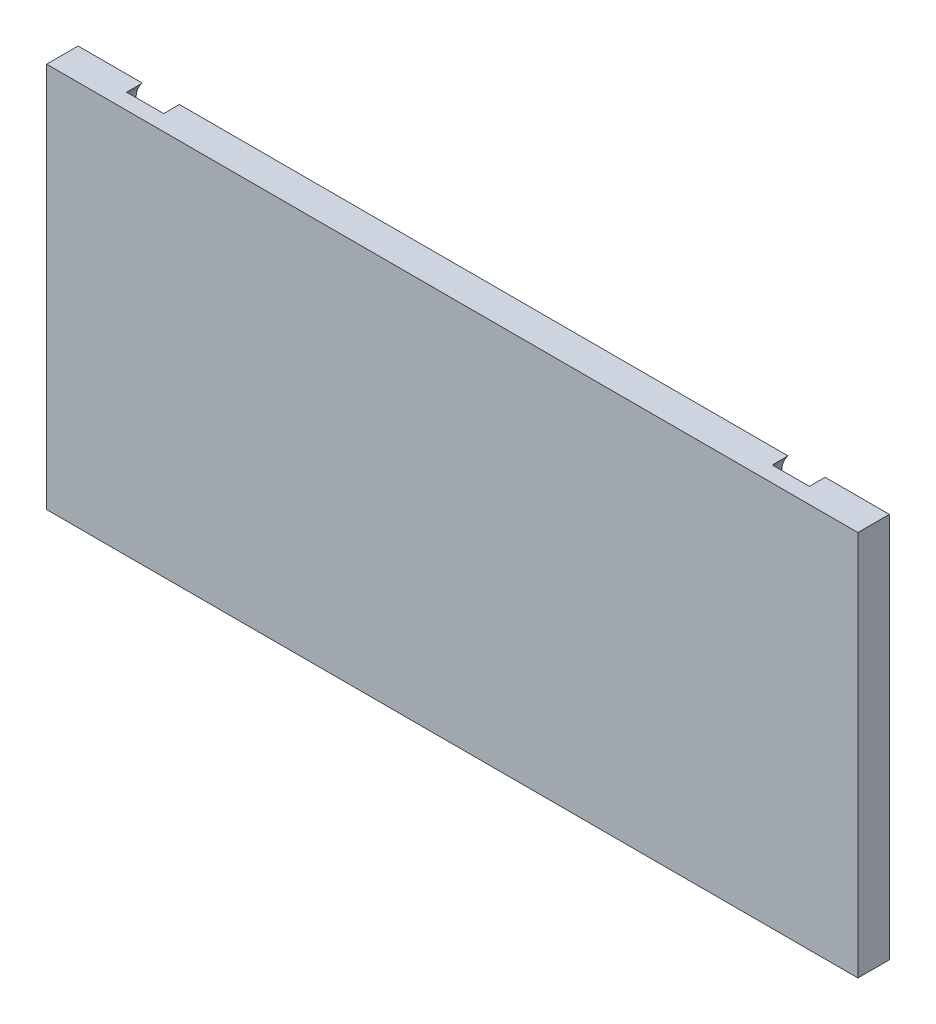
ISO-10303-21;
HEADER;
FILE_DESCRIPTION(('STEP AP214'),'2;1');
FILE_NAME('part.step','',(''),(''),'','','');
FILE_SCHEMA(('AUTOMOTIVE_DESIGN { 1 0 10303 214 1 1 1 1 }'));
ENDSEC;
DATA;
#1=APPLICATION_CONTEXT('core data for automotive mechanical design processes');
#2=APPLICATION_PROTOCOL_DEFINITION('international standard','automotive_design',2000,#1);
#3=PRODUCT_CONTEXT('',#1,'mechanical');
#4=PRODUCT('Part','Part','',(#3));
#5=PRODUCT_RELATED_PRODUCT_CATEGORY('part','',(#4));
#6=PRODUCT_DEFINITION_FORMATION('','',#4);
#7=PRODUCT_DEFINITION_CONTEXT('part definition',#1,'design');
#8=PRODUCT_DEFINITION('design','',#6,#7);
#9=PRODUCT_DEFINITION_SHAPE('','',#8);
#10=(LENGTH_UNIT() NAMED_UNIT(*) SI_UNIT(.MILLI.,.METRE.));
#11=(NAMED_UNIT(*) PLANE_ANGLE_UNIT() SI_UNIT($,.RADIAN.));
#12=(NAMED_UNIT(*) SI_UNIT($,.STERADIAN.) SOLID_ANGLE_UNIT());
#13=UNCERTAINTY_MEASURE_WITH_UNIT(LENGTH_MEASURE(1.E-05),#10,'distance_accuracy_value','');
#14=(GEOMETRIC_REPRESENTATION_CONTEXT(3) GLOBAL_UNCERTAINTY_ASSIGNED_CONTEXT((#13)) GLOBAL_UNIT_ASSIGNED_CONTEXT((#10,
#11,#12)) REPRESENTATION_CONTEXT('',''));
#15=CARTESIAN_POINT('',(0.,0.,0.));
#16=DIRECTION('',(0.,0.,1.));
#17=DIRECTION('',(1.,0.,0.));
#18=AXIS2_PLACEMENT_3D('',#15,#16,#17);
#19=CARTESIAN_POINT('',(245.,-116.5,19.));
#20=DIRECTION('',(-1.,0.,0.));
#21=DIRECTION('',(0.,0.,1.));
#22=AXIS2_PLACEMENT_3D('',#19,#20,#21);
#23=PLANE('',#22);
#24=DIRECTION('',(0.,1.,0.));
#25=VECTOR('',#24,1.);
#26=CARTESIAN_POINT('',(245.,-116.5,0.));
#27=LINE('',#26,#25);
#28=CARTESIAN_POINT('',(245.,-116.5,0.));
#29=VERTEX_POINT('',#28);
#30=CARTESIAN_POINT('',(245.,116.5,0.));
#31=VERTEX_POINT('',#30);
#32=EDGE_CURVE('E176',#29,#31,#27,.T.);
#33=ORIENTED_EDGE('',*,*,#32,.T.);
#34=DIRECTION('',(0.,0.,-1.));
#35=VECTOR('',#34,1.);
#36=CARTESIAN_POINT('',(245.,116.5,19.));
#37=LINE('',#36,#35);
#38=CARTESIAN_POINT('',(245.,116.5,19.));
#39=VERTEX_POINT('',#38);
#40=EDGE_CURVE('E208',#39,#31,#37,.T.);
#41=ORIENTED_EDGE('',*,*,#40,.F.);
#42=DIRECTION('',(0.,1.,0.));
#43=VECTOR('',#42,1.);
#44=CARTESIAN_POINT('',(245.,-116.5,19.));
#45=LINE('',#44,#43);
#46=CARTESIAN_POINT('',(245.,-116.5,19.));
#47=VERTEX_POINT('',#46);
#48=EDGE_CURVE('E177',#47,#39,#45,.T.);
#49=ORIENTED_EDGE('',*,*,#48,.F.);
#50=DIRECTION('',(0.,0.,-1.));
#51=VECTOR('',#50,1.);
#52=CARTESIAN_POINT('',(245.,-116.5,19.));
#53=LINE('',#52,#51);
#54=EDGE_CURVE('E187',#47,#29,#53,.T.);
#55=ORIENTED_EDGE('',*,*,#54,.T.);
#56=EDGE_LOOP('',(#33,#41,#49,#55));
#57=FACE_BOUND('',#56,.T.);
#58=ADVANCED_FACE('F32',(#57),#23,.F.);
#59=CARTESIAN_POINT('',(-245.,116.5,19.));
#60=DIRECTION('',(0.,-1.,0.));
#61=DIRECTION('',(0.,0.,-1.));
#62=AXIS2_PLACEMENT_3D('',#59,#60,#61);
#63=PLANE('',#62);
#64=DIRECTION('',(1.,0.,0.));
#65=VECTOR('',#64,1.);
#66=CARTESIAN_POINT('',(-245.,116.5,9.5));
#67=LINE('',#66,#65);
#68=CARTESIAN_POINT('',(183.819660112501,116.5,9.5));
#69=VERTEX_POINT('',#68);
#70=CARTESIAN_POINT('',(206.180339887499,116.5,9.5));
#71=VERTEX_POINT('',#70);
#72=EDGE_CURVE('E11',#69,#71,#67,.T.);
#73=ORIENTED_EDGE('',*,*,#72,.F.);
#74=DIRECTION('',(0.,0.,-1.));
#75=VECTOR('',#74,1.);
#76=CARTESIAN_POINT('',(183.819660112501,116.5,9.5));
#77=LINE('',#76,#75);
#78=CARTESIAN_POINT('',(183.819660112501,116.5,0.));
#79=VERTEX_POINT('',#78);
#80=EDGE_CURVE('E174',#69,#79,#77,.T.);
#81=ORIENTED_EDGE('',*,*,#80,.T.);
#82=DIRECTION('',(-1.,0.,0.));
#83=VECTOR('',#82,1.);
#84=CARTESIAN_POINT('',(-245.,116.5,0.));
#85=LINE('',#84,#83);
#86=CARTESIAN_POINT('',(-183.819660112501,116.5,0.));
#87=VERTEX_POINT('',#86);
#88=EDGE_CURVE('E165',#79,#87,#85,.T.);
#89=ORIENTED_EDGE('',*,*,#88,.T.);
#90=DIRECTION('',(0.,0.,-1.));
#91=VECTOR('',#90,1.);
#92=CARTESIAN_POINT('',(-183.819660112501,116.5,9.5));
#93=LINE('',#92,#91);
#94=CARTESIAN_POINT('',(-183.819660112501,116.5,9.5));
#95=VERTEX_POINT('',#94);
#96=EDGE_CURVE('E46',#87,#95,#93,.F.);
#97=ORIENTED_EDGE('',*,*,#96,.T.);
#98=DIRECTION('',(1.,0.,0.));
#99=VECTOR('',#98,1.);
#100=CARTESIAN_POINT('',(-245.,116.5,9.5));
#101=LINE('',#100,#99);
#102=CARTESIAN_POINT('',(-206.180339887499,116.5,9.5));
#103=VERTEX_POINT('',#102);
#104=EDGE_CURVE('E39',#103,#95,#101,.T.);
#105=ORIENTED_EDGE('',*,*,#104,.F.);
#106=DIRECTION('',(0.,0.,-1.));
#107=VECTOR('',#106,1.);
#108=CARTESIAN_POINT('',(-206.180339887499,116.5,9.5));
#109=LINE('',#108,#107);
#110=CARTESIAN_POINT('',(-206.180339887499,116.5,0.));
#111=VERTEX_POINT('',#110);
#112=EDGE_CURVE('E157',#103,#111,#109,.T.);
#113=ORIENTED_EDGE('',*,*,#112,.T.);
#114=CARTESIAN_POINT('',(-245.,116.5,0.));
#115=VERTEX_POINT('',#114);
#116=EDGE_CURVE('E190',#111,#115,#85,.T.);
#117=ORIENTED_EDGE('',*,*,#116,.T.);
#118=DIRECTION('',(0.,0.,-1.));
#119=VECTOR('',#118,1.);
#120=CARTESIAN_POINT('',(-245.,116.5,19.));
#121=LINE('',#120,#119);
#122=CARTESIAN_POINT('',(-245.,116.5,19.));
#123=VERTEX_POINT('',#122);
#124=EDGE_CURVE('E205',#123,#115,#121,.T.);
#125=ORIENTED_EDGE('',*,*,#124,.F.);
#126=DIRECTION('',(-1.,0.,0.));
#127=VECTOR('',#126,1.);
#128=CARTESIAN_POINT('',(-245.,116.5,19.));
#129=LINE('',#128,#127);
#130=EDGE_CURVE('E180',#39,#123,#129,.T.);
#131=ORIENTED_EDGE('',*,*,#130,.F.);
#132=ORIENTED_EDGE('',*,*,#40,.T.);
#133=CARTESIAN_POINT('',(206.180339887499,116.5,0.));
#134=VERTEX_POINT('',#133);
#135=EDGE_CURVE('E191',#31,#134,#85,.T.);
#136=ORIENTED_EDGE('',*,*,#135,.T.);
#137=DIRECTION('',(0.,0.,-1.));
#138=VECTOR('',#137,1.);
#139=CARTESIAN_POINT('',(206.180339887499,116.5,9.5));
#140=LINE('',#139,#138);
#141=EDGE_CURVE('E54',#134,#71,#140,.F.);
#142=ORIENTED_EDGE('',*,*,#141,.T.);
#143=EDGE_LOOP('',(#73,#81,#89,#97,#105,#113,#117,#125,#131,#132,#136,#142));
#144=FACE_BOUND('',#143,.T.);
#145=ADVANCED_FACE('F162',(#144),#63,.F.);
#146=CARTESIAN_POINT('',(-245.,-116.5,19.));
#147=DIRECTION('',(1.,0.,0.));
#148=DIRECTION('',(0.,0.,-1.));
#149=AXIS2_PLACEMENT_3D('',#146,#147,#148);
#150=PLANE('',#149);
#151=DIRECTION('',(0.,-1.,0.));
#152=VECTOR('',#151,1.);
#153=CARTESIAN_POINT('',(-245.,-116.5,0.));
#154=LINE('',#153,#152);
#155=CARTESIAN_POINT('',(-245.,-116.5,0.));
#156=VERTEX_POINT('',#155);
#157=EDGE_CURVE('E194',#115,#156,#154,.T.);
#158=ORIENTED_EDGE('',*,*,#157,.T.);
#159=DIRECTION('',(0.,0.,-1.));
#160=VECTOR('',#159,1.);
#161=CARTESIAN_POINT('',(-245.,-116.5,19.));
#162=LINE('',#161,#160);
#163=CARTESIAN_POINT('',(-245.,-116.5,19.));
#164=VERTEX_POINT('',#163);
#165=EDGE_CURVE('E202',#164,#156,#162,.T.);
#166=ORIENTED_EDGE('',*,*,#165,.F.);
#167=DIRECTION('',(0.,-1.,0.));
#168=VECTOR('',#167,1.);
#169=CARTESIAN_POINT('',(-245.,-116.5,19.));
#170=LINE('',#169,#168);
#171=EDGE_CURVE('E183',#123,#164,#170,.T.);
#172=ORIENTED_EDGE('',*,*,#171,.F.);
#173=ORIENTED_EDGE('',*,*,#124,.T.);
#174=EDGE_LOOP('',(#158,#166,#172,#173));
#175=FACE_BOUND('',#174,.T.);
#176=ADVANCED_FACE('F222',(#175),#150,.F.);
#177=CARTESIAN_POINT('',(-245.,-116.5,19.));
#178=DIRECTION('',(0.,1.,0.));
#179=DIRECTION('',(0.,0.,1.));
#180=AXIS2_PLACEMENT_3D('',#177,#178,#179);
#181=PLANE('',#180);
#182=DIRECTION('',(-1.,0.,0.));
#183=VECTOR('',#182,1.);
#184=CARTESIAN_POINT('',(-245.,-116.5,9.5));
#185=LINE('',#184,#183);
#186=CARTESIAN_POINT('',(-183.819660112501,-116.5,9.5));
#187=VERTEX_POINT('',#186);
#188=CARTESIAN_POINT('',(-206.180339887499,-116.5,9.5));
#189=VERTEX_POINT('',#188);
#190=EDGE_CURVE('E142',#187,#189,#185,.T.);
#191=ORIENTED_EDGE('',*,*,#190,.F.);
#192=DIRECTION('',(0.,0.,-1.));
#193=VECTOR('',#192,1.);
#194=CARTESIAN_POINT('',(-183.819660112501,-116.5,9.5));
#195=LINE('',#194,#193);
#196=CARTESIAN_POINT('',(-183.819660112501,-116.5,0.));
#197=VERTEX_POINT('',#196);
#198=EDGE_CURVE('E166',#187,#197,#195,.T.);
#199=ORIENTED_EDGE('',*,*,#198,.T.);
#200=DIRECTION('',(1.,0.,0.));
#201=VECTOR('',#200,1.);
#202=CARTESIAN_POINT('',(-245.,-116.5,0.));
#203=LINE('',#202,#201);
#204=CARTESIAN_POINT('',(183.819660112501,-116.5,0.));
#205=VERTEX_POINT('',#204);
#206=EDGE_CURVE('E199',#197,#205,#203,.T.);
#207=ORIENTED_EDGE('',*,*,#206,.T.);
#208=DIRECTION('',(0.,0.,-1.));
#209=VECTOR('',#208,1.);
#210=CARTESIAN_POINT('',(183.819660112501,-116.5,9.5));
#211=LINE('',#210,#209);
#212=CARTESIAN_POINT('',(183.819660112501,-116.5,9.5));
#213=VERTEX_POINT('',#212);
#214=EDGE_CURVE('E132',#205,#213,#211,.F.);
#215=ORIENTED_EDGE('',*,*,#214,.T.);
#216=DIRECTION('',(-1.,0.,0.));
#217=VECTOR('',#216,1.);
#218=CARTESIAN_POINT('',(-245.,-116.5,9.5));
#219=LINE('',#218,#217);
#220=CARTESIAN_POINT('',(206.180339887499,-116.5,9.5));
#221=VERTEX_POINT('',#220);
#222=EDGE_CURVE('E136',#221,#213,#219,.T.);
#223=ORIENTED_EDGE('',*,*,#222,.F.);
#224=DIRECTION('',(0.,0.,-1.));
#225=VECTOR('',#224,1.);
#226=CARTESIAN_POINT('',(206.180339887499,-116.5,9.5));
#227=LINE('',#226,#225);
#228=CARTESIAN_POINT('',(206.180339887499,-116.5,0.));
#229=VERTEX_POINT('',#228);
#230=EDGE_CURVE('E121',#221,#229,#227,.T.);
#231=ORIENTED_EDGE('',*,*,#230,.T.);
#232=EDGE_CURVE('E196',#229,#29,#203,.T.);
#233=ORIENTED_EDGE('',*,*,#232,.T.);
#234=ORIENTED_EDGE('',*,*,#54,.F.);
#235=DIRECTION('',(1.,0.,0.));
#236=VECTOR('',#235,1.);
#237=CARTESIAN_POINT('',(-245.,-116.5,19.));
#238=LINE('',#237,#236);
#239=EDGE_CURVE('E185',#164,#47,#238,.T.);
#240=ORIENTED_EDGE('',*,*,#239,.F.);
#241=ORIENTED_EDGE('',*,*,#165,.T.);
#242=CARTESIAN_POINT('',(-206.180339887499,-116.5,0.));
#243=VERTEX_POINT('',#242);
#244=EDGE_CURVE('E181',#156,#243,#203,.T.);
#245=ORIENTED_EDGE('',*,*,#244,.T.);
#246=DIRECTION('',(0.,0.,-1.));
#247=VECTOR('',#246,1.);
#248=CARTESIAN_POINT('',(-206.180339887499,-116.5,9.5));
#249=LINE('',#248,#247);
#250=EDGE_CURVE('E131',#243,#189,#249,.F.);
#251=ORIENTED_EDGE('',*,*,#250,.T.);
#252=EDGE_LOOP('',(#191,#199,#207,#215,#223,#231,#233,#234,#240,#241,#245,#251));
#253=FACE_BOUND('',#252,.T.);
#254=ADVANCED_FACE('F140',(#253),#181,.F.);
#255=CARTESIAN_POINT('',(0.,0.,19.));
#256=DIRECTION('',(0.,0.,-1.));
#257=DIRECTION('',(-1.,0.,0.));
#258=AXIS2_PLACEMENT_3D('',#255,#256,#257);
#259=PLANE('',#258);
#260=ORIENTED_EDGE('',*,*,#48,.T.);
#261=ORIENTED_EDGE('',*,*,#130,.T.);
#262=ORIENTED_EDGE('',*,*,#171,.T.);
#263=ORIENTED_EDGE('',*,*,#239,.T.);
#264=EDGE_LOOP('',(#260,#261,#262,#263));
#265=FACE_BOUND('',#264,.T.);
#266=ADVANCED_FACE('F229',(#265),#259,.F.);
#267=CARTESIAN_POINT('',(0.,0.,0.));
#268=DIRECTION('',(0.,0.,-1.));
#269=DIRECTION('',(-1.,0.,0.));
#270=AXIS2_PLACEMENT_3D('',#267,#268,#269);
#271=PLANE('',#270);
#272=CARTESIAN_POINT('',(195.,106.5,0.));
#273=DIRECTION('',(0.,0.,-1.));
#274=DIRECTION('',(-1.,0.,0.));
#275=AXIS2_PLACEMENT_3D('',#272,#273,#274);
#276=CIRCLE('',#275,15.);
#277=EDGE_CURVE('E143',#134,#79,#276,.T.);
#278=ORIENTED_EDGE('',*,*,#277,.F.);
#279=ORIENTED_EDGE('',*,*,#135,.F.);
#280=ORIENTED_EDGE('',*,*,#32,.F.);
#281=ORIENTED_EDGE('',*,*,#232,.F.);
#282=CARTESIAN_POINT('',(195.,-106.5,0.));
#283=DIRECTION('',(0.,0.,-1.));
#284=DIRECTION('',(-1.,0.,0.));
#285=AXIS2_PLACEMENT_3D('',#282,#283,#284);
#286=CIRCLE('',#285,15.);
#287=EDGE_CURVE('E127',#205,#229,#286,.T.);
#288=ORIENTED_EDGE('',*,*,#287,.F.);
#289=ORIENTED_EDGE('',*,*,#206,.F.);
#290=CARTESIAN_POINT('',(-195.,-106.5,0.));
#291=DIRECTION('',(0.,0.,-1.));
#292=DIRECTION('',(-1.,0.,0.));
#293=AXIS2_PLACEMENT_3D('',#290,#291,#292);
#294=CIRCLE('',#293,15.);
#295=EDGE_CURVE('E212',#243,#197,#294,.T.);
#296=ORIENTED_EDGE('',*,*,#295,.F.);
#297=ORIENTED_EDGE('',*,*,#244,.F.);
#298=ORIENTED_EDGE('',*,*,#157,.F.);
#299=ORIENTED_EDGE('',*,*,#116,.F.);
#300=CARTESIAN_POINT('',(-195.,106.5,0.));
#301=DIRECTION('',(0.,0.,-1.));
#302=DIRECTION('',(-1.,0.,0.));
#303=AXIS2_PLACEMENT_3D('',#300,#301,#302);
#304=CIRCLE('',#303,15.);
#305=EDGE_CURVE('E146',#87,#111,#304,.T.);
#306=ORIENTED_EDGE('',*,*,#305,.F.);
#307=ORIENTED_EDGE('',*,*,#88,.F.);
#308=EDGE_LOOP('',(#278,#279,#280,#281,#288,#289,#296,#297,#298,#299,#306,#307));
#309=FACE_BOUND('',#308,.T.);
#310=ADVANCED_FACE('F217',(#309),#271,.T.);
#311=CARTESIAN_POINT('',(195.,-106.5,9.5));
#312=DIRECTION('',(0.,0.,-1.));
#313=DIRECTION('',(-1.,0.,0.));
#314=AXIS2_PLACEMENT_3D('',#311,#312,#313);
#315=PLANE('',#314);
#316=ORIENTED_EDGE('',*,*,#222,.T.);
#317=CARTESIAN_POINT('',(195.,-106.5,9.5));
#318=DIRECTION('',(0.,0.,-1.));
#319=DIRECTION('',(-1.,0.,0.));
#320=AXIS2_PLACEMENT_3D('',#317,#318,#319);
#321=CIRCLE('',#320,15.);
#322=EDGE_CURVE('E124',#213,#221,#321,.T.);
#323=ORIENTED_EDGE('',*,*,#322,.T.);
#324=EDGE_LOOP('',(#316,#323));
#325=FACE_BOUND('',#324,.T.);
#326=ADVANCED_FACE('F135',(#325),#315,.T.);
#327=CARTESIAN_POINT('',(195.,-106.5,9.5));
#328=DIRECTION('',(0.,0.,-1.));
#329=DIRECTION('',(-1.,0.,0.));
#330=AXIS2_PLACEMENT_3D('',#327,#328,#329);
#331=CYLINDRICAL_SURFACE('',#330,15.);
#332=ORIENTED_EDGE('',*,*,#322,.F.);
#333=ORIENTED_EDGE('',*,*,#214,.F.);
#334=ORIENTED_EDGE('',*,*,#287,.T.);
#335=ORIENTED_EDGE('',*,*,#230,.F.);
#336=EDGE_LOOP('',(#332,#333,#334,#335));
#337=FACE_BOUND('',#336,.T.);
#338=ADVANCED_FACE('F123',(#337),#331,.F.);
#339=CARTESIAN_POINT('',(-195.,-106.5,9.5));
#340=DIRECTION('',(0.,0.,-1.));
#341=DIRECTION('',(-1.,0.,0.));
#342=AXIS2_PLACEMENT_3D('',#339,#340,#341);
#343=PLANE('',#342);
#344=ORIENTED_EDGE('',*,*,#190,.T.);
#345=CARTESIAN_POINT('',(-195.,-106.5,9.5));
#346=DIRECTION('',(0.,0.,-1.));
#347=DIRECTION('',(-1.,0.,0.));
#348=AXIS2_PLACEMENT_3D('',#345,#346,#347);
#349=CIRCLE('',#348,15.);
#350=EDGE_CURVE('E137',#189,#187,#349,.T.);
#351=ORIENTED_EDGE('',*,*,#350,.T.);
#352=EDGE_LOOP('',(#344,#351));
#353=FACE_BOUND('',#352,.T.);
#354=ADVANCED_FACE('F246',(#353),#343,.T.);
#355=CARTESIAN_POINT('',(-195.,-106.5,9.5));
#356=DIRECTION('',(0.,0.,-1.));
#357=DIRECTION('',(-1.,0.,0.));
#358=AXIS2_PLACEMENT_3D('',#355,#356,#357);
#359=CYLINDRICAL_SURFACE('',#358,15.);
#360=ORIENTED_EDGE('',*,*,#350,.F.);
#361=ORIENTED_EDGE('',*,*,#250,.F.);
#362=ORIENTED_EDGE('',*,*,#295,.T.);
#363=ORIENTED_EDGE('',*,*,#198,.F.);
#364=EDGE_LOOP('',(#360,#361,#362,#363));
#365=FACE_BOUND('',#364,.T.);
#366=ADVANCED_FACE('F242',(#365),#359,.F.);
#367=CARTESIAN_POINT('',(-195.,106.5,9.5));
#368=DIRECTION('',(0.,0.,-1.));
#369=DIRECTION('',(-1.,0.,0.));
#370=AXIS2_PLACEMENT_3D('',#367,#368,#369);
#371=PLANE('',#370);
#372=ORIENTED_EDGE('',*,*,#104,.T.);
#373=CARTESIAN_POINT('',(-195.,106.5,9.5));
#374=DIRECTION('',(0.,0.,-1.));
#375=DIRECTION('',(-1.,0.,0.));
#376=AXIS2_PLACEMENT_3D('',#373,#374,#375);
#377=CIRCLE('',#376,15.);
#378=EDGE_CURVE('E153',#95,#103,#377,.T.);
#379=ORIENTED_EDGE('',*,*,#378,.T.);
#380=EDGE_LOOP('',(#372,#379));
#381=FACE_BOUND('',#380,.T.);
#382=ADVANCED_FACE('F152',(#381),#371,.T.);
#383=CARTESIAN_POINT('',(-195.,106.5,9.5));
#384=DIRECTION('',(0.,0.,-1.));
#385=DIRECTION('',(-1.,0.,0.));
#386=AXIS2_PLACEMENT_3D('',#383,#384,#385);
#387=CYLINDRICAL_SURFACE('',#386,15.);
#388=ORIENTED_EDGE('',*,*,#378,.F.);
#389=ORIENTED_EDGE('',*,*,#96,.F.);
#390=ORIENTED_EDGE('',*,*,#305,.T.);
#391=ORIENTED_EDGE('',*,*,#112,.F.);
#392=EDGE_LOOP('',(#388,#389,#390,#391));
#393=FACE_BOUND('',#392,.T.);
#394=ADVANCED_FACE('F156',(#393),#387,.F.);
#395=CARTESIAN_POINT('',(195.,106.5,9.5));
#396=DIRECTION('',(0.,0.,-1.));
#397=DIRECTION('',(-1.,0.,0.));
#398=AXIS2_PLACEMENT_3D('',#395,#396,#397);
#399=PLANE('',#398);
#400=ORIENTED_EDGE('',*,*,#72,.T.);
#401=CARTESIAN_POINT('',(195.,106.5,9.5));
#402=DIRECTION('',(0.,0.,-1.));
#403=DIRECTION('',(-1.,0.,0.));
#404=AXIS2_PLACEMENT_3D('',#401,#402,#403);
#405=CIRCLE('',#404,15.);
#406=EDGE_CURVE('E158',#71,#69,#405,.T.);
#407=ORIENTED_EDGE('',*,*,#406,.T.);
#408=EDGE_LOOP('',(#400,#407));
#409=FACE_BOUND('',#408,.T.);
#410=ADVANCED_FACE('F236',(#409),#399,.T.);
#411=CARTESIAN_POINT('',(195.,106.5,9.5));
#412=DIRECTION('',(0.,0.,-1.));
#413=DIRECTION('',(-1.,0.,0.));
#414=AXIS2_PLACEMENT_3D('',#411,#412,#413);
#415=CYLINDRICAL_SURFACE('',#414,15.);
#416=ORIENTED_EDGE('',*,*,#406,.F.);
#417=ORIENTED_EDGE('',*,*,#141,.F.);
#418=ORIENTED_EDGE('',*,*,#277,.T.);
#419=ORIENTED_EDGE('',*,*,#80,.F.);
#420=EDGE_LOOP('',(#416,#417,#418,#419));
#421=FACE_BOUND('',#420,.T.);
#422=ADVANCED_FACE('F233',(#421),#415,.F.);
#423=CLOSED_SHELL('',(#58,#145,#176,#254,#266,#310,#326,#338,#354,#366,#382,#394,#410,#422));
#424=MANIFOLD_SOLID_BREP('B2',#423);
#425=ADVANCED_BREP_SHAPE_REPRESENTATION('',(#18,#424),#14);
#426=SHAPE_DEFINITION_REPRESENTATION(#9,#425);
ENDSEC;
END-ISO-10303-21;
